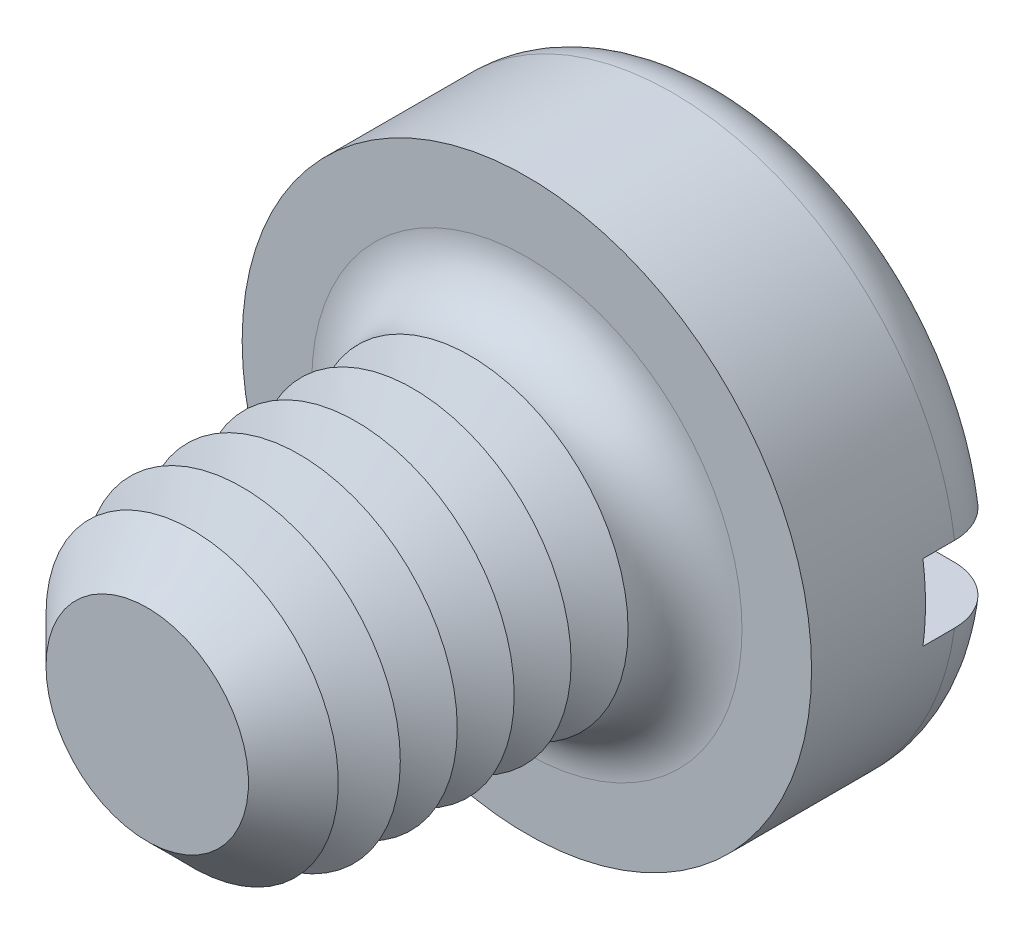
ISO-10303-21;
HEADER;
FILE_DESCRIPTION(('STEP AP214'),'2;1');
FILE_NAME('part.step','',(''),(''),'','','');
FILE_SCHEMA(('AUTOMOTIVE_DESIGN { 1 0 10303 214 1 1 1 1 }'));
ENDSEC;
DATA;
#1=APPLICATION_CONTEXT('core data for automotive mechanical design processes');
#2=APPLICATION_PROTOCOL_DEFINITION('international standard','automotive_design',2000,#1);
#3=PRODUCT_CONTEXT('',#1,'mechanical');
#4=PRODUCT('Part','Part','',(#3));
#5=PRODUCT_RELATED_PRODUCT_CATEGORY('part','',(#4));
#6=PRODUCT_DEFINITION_FORMATION('','',#4);
#7=PRODUCT_DEFINITION_CONTEXT('part definition',#1,'design');
#8=PRODUCT_DEFINITION('design','',#6,#7);
#9=PRODUCT_DEFINITION_SHAPE('','',#8);
#10=(LENGTH_UNIT() NAMED_UNIT(*) SI_UNIT(.MILLI.,.METRE.));
#11=(NAMED_UNIT(*) PLANE_ANGLE_UNIT() SI_UNIT($,.RADIAN.));
#12=(NAMED_UNIT(*) SI_UNIT($,.STERADIAN.) SOLID_ANGLE_UNIT());
#13=UNCERTAINTY_MEASURE_WITH_UNIT(LENGTH_MEASURE(1.E-05),#10,'distance_accuracy_value','');
#14=(GEOMETRIC_REPRESENTATION_CONTEXT(3) GLOBAL_UNCERTAINTY_ASSIGNED_CONTEXT((#13)) GLOBAL_UNIT_ASSIGNED_CONTEXT((#10,
#11,#12)) REPRESENTATION_CONTEXT('',''));
#15=CARTESIAN_POINT('',(0.,0.,0.));
#16=DIRECTION('',(0.,0.,1.));
#17=DIRECTION('',(1.,0.,0.));
#18=AXIS2_PLACEMENT_3D('',#15,#16,#17);
#19=CARTESIAN_POINT('',(0.,0.,-1.6));
#20=DIRECTION('',(0.,0.,1.));
#21=DIRECTION('',(1.,0.,0.));
#22=AXIS2_PLACEMENT_3D('',#19,#20,#21);
#23=PLANE('',#22);
#24=CARTESIAN_POINT('',(0.,0.,-1.6));
#25=DIRECTION('',(0.,0.,1.));
#26=DIRECTION('',(1.,0.,0.));
#27=AXIS2_PLACEMENT_3D('',#24,#25,#26);
#28=CIRCLE('',#27,1.8);
#29=CARTESIAN_POINT('',(-1.77482393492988,0.3,-1.6));
#30=VERTEX_POINT('',#29);
#31=CARTESIAN_POINT('',(1.77482393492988,0.3,-1.6));
#32=VERTEX_POINT('',#31);
#33=EDGE_CURVE('E116',#30,#32,#28,.F.);
#34=ORIENTED_EDGE('',*,*,#33,.T.);
#35=DIRECTION('',(1.,0.,0.));
#36=VECTOR('',#35,1.);
#37=CARTESIAN_POINT('',(-2.25,0.3,-1.6));
#38=LINE('',#37,#36);
#39=EDGE_CURVE('E111',#30,#32,#38,.T.);
#40=ORIENTED_EDGE('',*,*,#39,.F.);
#41=EDGE_LOOP('',(#34,#40));
#42=FACE_BOUND('',#41,.T.);
#43=ADVANCED_FACE('F39',(#42),#23,.F.);
#44=CARTESIAN_POINT('',(0.,0.,-1.15));
#45=DIRECTION('',(0.,0.,1.));
#46=DIRECTION('',(1.,0.,0.));
#47=AXIS2_PLACEMENT_3D('',#44,#45,#46);
#48=TOROIDAL_SURFACE('',#47,1.8,0.45);
#49=CARTESIAN_POINT('',(-2.09367249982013,0.3,-1.4713087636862));
#50=CARTESIAN_POINT('',(-2.07531034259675,0.3,-1.48912990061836));
#51=CARTESIAN_POINT('',(-2.05541605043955,0.3,-1.50540110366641));
#52=CARTESIAN_POINT('',(-2.01315405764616,0.3,-1.53437465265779));
#53=CARTESIAN_POINT('',(-1.99078310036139,0.3,-1.54707221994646));
#54=CARTESIAN_POINT('',(-1.94425163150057,0.3,-1.56853090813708));
#55=CARTESIAN_POINT('',(-1.92009286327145,0.3,-1.57729580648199));
#56=CARTESIAN_POINT('',(-1.8706617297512,0.3,-1.59068015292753));
#57=CARTESIAN_POINT('',(-1.84538964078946,0.3,-1.59530062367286));
#58=CARTESIAN_POINT('',(-1.7942134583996,0.3,-1.60031507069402));
#59=CARTESIAN_POINT('',(-1.76830582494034,0.3,-1.60067291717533));
#60=CARTESIAN_POINT('',(-1.71679040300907,0.3,-1.59707477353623));
#61=CARTESIAN_POINT('',(-1.69118264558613,0.3,-1.59311834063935));
#62=CARTESIAN_POINT('',(-1.64075792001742,0.3,-1.58095464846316));
#63=CARTESIAN_POINT('',(-1.61594989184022,0.3,-1.57271029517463));
#64=CARTESIAN_POINT('',(-1.56806655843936,0.3,-1.55217762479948));
#65=CARTESIAN_POINT('',(-1.54499130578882,0.3,-1.53988918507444));
#66=CARTESIAN_POINT('',(-1.50122413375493,0.3,-1.51158963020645));
#67=CARTESIAN_POINT('',(-1.48053389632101,0.3,-1.49557591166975));
#68=CARTESIAN_POINT('',(-1.44217532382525,0.3,-1.46026359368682));
#69=CARTESIAN_POINT('',(-1.42450683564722,0.3,-1.4409651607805));
#70=CARTESIAN_POINT('',(-1.39293961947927,0.3,-1.39986821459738));
#71=CARTESIAN_POINT('',(-1.37899788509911,0.3,-1.37810275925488));
#72=CARTESIAN_POINT('',(-1.35506190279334,0.3,-1.33249939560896));
#73=CARTESIAN_POINT('',(-1.34506709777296,0.3,-1.30866178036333));
#74=CARTESIAN_POINT('',(-1.3295415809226,0.3,-1.26015137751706));
#75=CARTESIAN_POINT('',(-1.32391771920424,0.3,-1.23550839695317));
#76=CARTESIAN_POINT('',(-1.31696995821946,0.3,-1.18562442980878));
#77=CARTESIAN_POINT('',(-1.31564552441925,0.3,-1.16038351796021));
#78=CARTESIAN_POINT('',(-1.31732714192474,0.3,-1.11049178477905));
#79=CARTESIAN_POINT('',(-1.32025766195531,0.3,-1.08583837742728));
#80=CARTESIAN_POINT('',(-1.3302124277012,0.3,-1.03737369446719));
#81=CARTESIAN_POINT('',(-1.33723664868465,0.3,-1.01356241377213));
#82=CARTESIAN_POINT('',(-1.35515820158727,0.3,-0.967413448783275));
#83=CARTESIAN_POINT('',(-1.36606032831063,0.3,-0.945077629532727));
#84=CARTESIAN_POINT('',(-1.39139351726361,0.3,-0.902507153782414));
#85=CARTESIAN_POINT('',(-1.40582489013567,0.3,-0.882272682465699));
#86=CARTESIAN_POINT('',(-1.43808691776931,0.3,-0.844072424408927));
#87=CARTESIAN_POINT('',(-1.4559757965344,0.3,-0.826155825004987));
#88=CARTESIAN_POINT('',(-1.49445205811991,0.3,-0.793502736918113));
#89=CARTESIAN_POINT('',(-1.51503974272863,0.3,-0.778766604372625));
#90=CARTESIAN_POINT('',(-1.55880475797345,0.3,-0.752571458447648));
#91=CARTESIAN_POINT('',(-1.58202794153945,0.3,-0.741189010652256));
#92=CARTESIAN_POINT('',(-1.63004083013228,0.3,-0.722432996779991));
#93=CARTESIAN_POINT('',(-1.65483064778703,0.3,-0.715059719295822));
#94=CARTESIAN_POINT('',(-1.70558060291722,0.3,-0.704463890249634));
#95=CARTESIAN_POINT('',(-1.73155090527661,0.3,-0.701289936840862));
#96=CARTESIAN_POINT('',(-1.78365633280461,0.3,-0.699350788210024));
#97=CARTESIAN_POINT('',(-1.80979145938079,0.3,-0.700585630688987));
#98=CARTESIAN_POINT('',(-1.86145503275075,0.3,-0.70744393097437));
#99=CARTESIAN_POINT('',(-1.88698403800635,0.3,-0.713063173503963));
#100=CARTESIAN_POINT('',(-1.93672112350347,0.3,-0.728546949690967));
#101=CARTESIAN_POINT('',(-1.96092925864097,0.3,-0.738411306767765));
#102=CARTESIAN_POINT('',(-2.00710191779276,0.3,-0.762015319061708));
#103=CARTESIAN_POINT('',(-2.02908465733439,0.3,-0.775719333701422));
#104=CARTESIAN_POINT('',(-2.0704025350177,0.3,-0.806663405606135));
#105=CARTESIAN_POINT('',(-2.08973782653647,0.3,-0.823903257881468));
#106=CARTESIAN_POINT('',(-2.12497879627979,0.3,-0.861218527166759));
#107=CARTESIAN_POINT('',(-2.1409209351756,0.3,-0.881259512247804));
#108=CARTESIAN_POINT('',(-2.16917502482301,0.3,-0.92375535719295));
#109=CARTESIAN_POINT('',(-2.18148717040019,0.3,-0.946210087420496));
#110=CARTESIAN_POINT('',(-2.20201023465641,0.3,-0.99266079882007));
#111=CARTESIAN_POINT('',(-2.21025973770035,0.3,-1.01663973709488));
#112=CARTESIAN_POINT('',(-2.22258852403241,0.3,-1.06564563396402));
#113=CARTESIAN_POINT('',(-2.22666813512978,0.3,-1.0906725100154));
#114=CARTESIAN_POINT('',(-2.23052418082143,0.3,-1.14090288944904));
#115=CARTESIAN_POINT('',(-2.23032644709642,0.3,-1.16610441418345));
#116=CARTESIAN_POINT('',(-2.22569614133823,0.3,-1.21612212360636));
#117=CARTESIAN_POINT('',(-2.2212625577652,0.3,-1.24093821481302));
#118=CARTESIAN_POINT('',(-2.20829785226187,0.3,-1.2894516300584));
#119=CARTESIAN_POINT('',(-2.19976997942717,0.3,-1.31314982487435));
#120=CARTESIAN_POINT('',(-2.17887390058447,0.3,-1.35876313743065));
#121=CARTESIAN_POINT('',(-2.1665103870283,0.3,-1.3806803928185));
#122=CARTESIAN_POINT('',(-2.14384463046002,0.3,-1.4140108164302));
#123=CARTESIAN_POINT('',(-2.13462949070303,0.3,-1.42617780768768));
#124=CARTESIAN_POINT('',(-2.1150151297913,0.3,-1.44951629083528));
#125=CARTESIAN_POINT('',(-2.10461591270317,0.3,-1.46068778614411));
#126=CARTESIAN_POINT('',(-2.09367249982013,0.3,-1.4713087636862));
#127=B_SPLINE_CURVE_WITH_KNOTS('',3,(#49,#50,#51,#52,#53,#54,#55,#56,#57,#58,#59,#60,#61,#62,
#63,#64,#65,#66,#67,#68,#69,#70,#71,#72,#73,#74,#75,#76,#77,#78,#79,#80,#81,#82,#83,#84,#85,#86,
#87,#88,#89,#90,#91,#92,#93,#94,#95,#96,#97,#98,#99,#100,#101,#102,#103,#104,#105,#106,#107,
#108,#109,#110,#111,#112,#113,#114,#115,#116,#117,#118,#119,#120,#121,#122,#123,#124,#125,#126),
.UNSPECIFIED.,.T.,.F.,(4,2,2,2,2,2,2,2,2,2,2,2,2,2,2,2,2,2,2,2,2,2,2,2,2,2,2,2,2,2,2,2,2,2,2,2,
2,2,4),(0.,0.0767085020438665,0.153519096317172,0.230255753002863,0.306973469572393,
0.384340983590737,0.461716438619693,0.539772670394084,0.617831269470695,0.695944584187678,
0.774053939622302,0.851218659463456,0.928372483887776,1.00383319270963,1.07928451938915,
1.15341274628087,1.22754052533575,1.30176027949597,1.37598656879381,1.45159320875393,
1.52720831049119,1.6044355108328,1.68166826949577,1.75978723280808,1.8379068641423,
1.91595148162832,1.99399285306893,2.07133254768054,2.14866775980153,2.22512456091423,
2.30157725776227,2.3772891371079,2.45299506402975,2.52824391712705,2.60351074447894,
2.67871794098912,2.75383349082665,2.79955010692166,2.84526656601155),.UNSPECIFIED.);
#128=CARTESIAN_POINT('',(-2.22991031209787,0.3,-1.14999999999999));
#129=VERTEX_POINT('',#128);
#130=EDGE_CURVE('E225',#129,#30,#127,.T.);
#131=ORIENTED_EDGE('',*,*,#130,.F.);
#132=CARTESIAN_POINT('',(0.,0.,-1.15));
#133=DIRECTION('',(0.,0.,1.));
#134=DIRECTION('',(1.,0.,0.));
#135=AXIS2_PLACEMENT_3D('',#132,#133,#134);
#136=CIRCLE('',#135,2.25);
#137=CARTESIAN_POINT('',(2.22991031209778,0.3,-1.15));
#138=VERTEX_POINT('',#137);
#139=EDGE_CURVE('E125',#138,#129,#136,.T.);
#140=ORIENTED_EDGE('',*,*,#139,.F.);
#141=CARTESIAN_POINT('',(1.39325818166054,0.3,-1.39903402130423));
#142=CARTESIAN_POINT('',(1.40771723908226,0.3,-1.42030595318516));
#143=CARTESIAN_POINT('',(1.4240122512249,0.3,-1.4403555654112));
#144=CARTESIAN_POINT('',(1.45976320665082,0.3,-1.4774406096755));
#145=CARTESIAN_POINT('',(1.47922380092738,0.3,-1.49447152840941));
#146=CARTESIAN_POINT('',(1.5206923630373,0.3,-1.52502510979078));
#147=CARTESIAN_POINT('',(1.54269721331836,0.3,-1.53855200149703));
#148=CARTESIAN_POINT('',(1.58863815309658,0.3,-1.56176272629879));
#149=CARTESIAN_POINT('',(1.61257369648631,0.3,-1.57144764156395));
#150=CARTESIAN_POINT('',(1.66199169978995,0.3,-1.58680804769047));
#151=CARTESIAN_POINT('',(1.68748839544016,0.3,-1.59243778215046));
#152=CARTESIAN_POINT('',(1.73906656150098,0.3,-1.59934902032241));
#153=CARTESIAN_POINT('',(1.76514807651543,0.3,-1.60063019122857));
#154=CARTESIAN_POINT('',(1.81721740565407,0.3,-1.59879130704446));
#155=CARTESIAN_POINT('',(1.84320486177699,0.3,-1.59566102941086));
#156=CARTESIAN_POINT('',(1.89427635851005,0.3,-1.58504931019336));
#157=CARTESIAN_POINT('',(1.91936042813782,0.3,-1.57756800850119));
#158=CARTESIAN_POINT('',(1.9677137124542,0.3,-1.55851722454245));
#159=CARTESIAN_POINT('',(1.99099484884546,0.3,-1.5469780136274));
#160=CARTESIAN_POINT('',(2.03525897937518,0.3,-1.52011224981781));
#161=CARTESIAN_POINT('',(2.05624211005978,0.3,-1.50478592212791));
#162=CARTESIAN_POINT('',(2.09506403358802,0.3,-1.47096472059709));
#163=CARTESIAN_POINT('',(2.11293536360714,0.3,-1.45250719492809));
#164=CARTESIAN_POINT('',(2.14528563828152,0.3,-1.41282609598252));
#165=CARTESIAN_POINT('',(2.15976477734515,0.3,-1.39160268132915));
#166=CARTESIAN_POINT('',(2.18476262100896,0.3,-1.34723254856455));
#167=CARTESIAN_POINT('',(2.19532119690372,0.3,-1.32410828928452));
#168=CARTESIAN_POINT('',(2.21237438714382,0.3,-1.27640693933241));
#169=CARTESIAN_POINT('',(2.21886918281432,0.3,-1.25182991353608));
#170=CARTESIAN_POINT('',(2.2275687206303,0.3,-1.20210937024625));
#171=CARTESIAN_POINT('',(2.22980376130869,0.3,-1.17697115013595));
#172=CARTESIAN_POINT('',(2.23000940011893,0.3,-1.12667754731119));
#173=CARTESIAN_POINT('',(2.22798009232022,0.3,-1.10152216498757));
#174=CARTESIAN_POINT('',(2.21972856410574,0.3,-1.05197773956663));
#175=CARTESIAN_POINT('',(2.21351744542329,0.3,-1.02758684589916));
#176=CARTESIAN_POINT('',(2.19709696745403,0.3,-0.980190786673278));
#177=CARTESIAN_POINT('',(2.18688760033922,0.3,-0.957185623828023));
#178=CARTESIAN_POINT('',(2.1627435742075,0.3,-0.913157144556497));
#179=CARTESIAN_POINT('',(2.14880093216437,0.3,-0.892138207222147));
#180=CARTESIAN_POINT('',(2.11760640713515,0.3,-0.852719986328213));
#181=CARTESIAN_POINT('',(2.10035443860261,0.3,-0.834320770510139));
#182=CARTESIAN_POINT('',(2.06291254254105,0.3,-0.80052923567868));
#183=CARTESIAN_POINT('',(2.04270386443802,0.3,-0.785157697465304));
#184=CARTESIAN_POINT('',(2.0000139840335,0.3,-0.757986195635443));
#185=CARTESIAN_POINT('',(1.97753267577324,0.3,-0.746186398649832));
#186=CARTESIAN_POINT('',(1.93069507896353,0.3,-0.726364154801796));
#187=CARTESIAN_POINT('',(1.90632219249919,0.3,-0.718380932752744));
#188=CARTESIAN_POINT('',(1.85658993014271,0.3,-0.706569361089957));
#189=CARTESIAN_POINT('',(1.83123049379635,0.3,-0.702741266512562));
#190=CARTESIAN_POINT('',(1.77994107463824,0.3,-0.699306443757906));
#191=CARTESIAN_POINT('',(1.75400788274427,0.3,-0.69974759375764));
#192=CARTESIAN_POINT('',(1.70257608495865,0.3,-0.704939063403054));
#193=CARTESIAN_POINT('',(1.67707750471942,0.3,-0.709689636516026));
#194=CARTESIAN_POINT('',(1.62701662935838,0.3,-0.723419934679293));
#195=CARTESIAN_POINT('',(1.60246387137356,0.3,-0.732434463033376));
#196=CARTESIAN_POINT('',(1.55521886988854,0.3,-0.754458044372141));
#197=CARTESIAN_POINT('',(1.53252668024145,0.3,-0.76746721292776));
#198=CARTESIAN_POINT('',(1.48966925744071,0.3,-0.797124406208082));
#199=CARTESIAN_POINT('',(1.46950315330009,0.3,-0.813771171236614));
#200=CARTESIAN_POINT('',(1.43229728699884,0.3,-0.850255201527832));
#201=CARTESIAN_POINT('',(1.41525734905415,0.3,-0.870092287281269));
#202=CARTESIAN_POINT('',(1.3850470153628,0.3,-0.912123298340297));
#203=CARTESIAN_POINT('',(1.37182821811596,0.3,-0.934282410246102));
#204=CARTESIAN_POINT('',(1.34939737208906,0.3,-0.980542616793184));
#205=CARTESIAN_POINT('',(1.34018456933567,0.3,-1.00464334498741));
#206=CARTESIAN_POINT('',(1.32624172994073,0.3,-1.05352472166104));
#207=CARTESIAN_POINT('',(1.32141599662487,0.3,-1.07827808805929));
#208=CARTESIAN_POINT('',(1.31606478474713,0.3,-1.12825155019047));
#209=CARTESIAN_POINT('',(1.31553992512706,0.3,-1.15347171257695));
#210=CARTESIAN_POINT('',(1.31878307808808,0.3,-1.20323022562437));
#211=CARTESIAN_POINT('',(1.32248353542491,0.3,-1.22777305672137));
#212=CARTESIAN_POINT('',(1.33394086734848,0.3,-1.27586981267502));
#213=CARTESIAN_POINT('',(1.34169274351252,0.3,-1.2994249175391));
#214=CARTESIAN_POINT('',(1.35704250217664,0.3,-1.33561898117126));
#215=CARTESIAN_POINT('',(1.36341395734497,0.3,-1.34879219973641));
#216=CARTESIAN_POINT('',(1.37741190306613,0.3,-1.37445328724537));
#217=CARTESIAN_POINT('',(1.38503837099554,0.3,-1.38694116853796));
#218=CARTESIAN_POINT('',(1.39325818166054,0.3,-1.39903402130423));
#219=B_SPLINE_CURVE_WITH_KNOTS('',3,(#141,#142,#143,#144,#145,#146,#147,#148,#149,#150,#151,
#152,#153,#154,#155,#156,#157,#158,#159,#160,#161,#162,#163,#164,#165,#166,#167,#168,#169,#170,
#171,#172,#173,#174,#175,#176,#177,#178,#179,#180,#181,#182,#183,#184,#185,#186,#187,#188,#189,
#190,#191,#192,#193,#194,#195,#196,#197,#198,#199,#200,#201,#202,#203,#204,#205,#206,#207,#208,
#209,#210,#211,#212,#213,#214,#215,#216,#217,#218),.UNSPECIFIED.,.T.,.F.,(4,2,2,2,2,2,2,2,2,2,2,
2,2,2,2,2,2,2,2,2,2,2,2,2,2,2,2,2,2,2,2,2,2,2,2,2,2,2,4),(0.,0.0771077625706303,
0.154329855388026,0.231458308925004,0.308565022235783,0.386528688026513,0.464498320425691,
0.542648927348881,0.620797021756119,0.698374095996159,0.77594655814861,0.852651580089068,
0.929352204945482,1.00524992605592,1.08114426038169,1.15649673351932,1.2318475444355,
1.30699910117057,1.38215080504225,1.45746451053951,1.53278016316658,1.60859599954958,
1.68441537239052,1.76099806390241,1.83758545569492,1.91503273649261,1.99248457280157,
2.07057979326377,2.14867727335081,2.22674775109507,2.30481383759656,2.38184276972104,
2.45885719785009,2.53414829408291,2.6094502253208,2.68356487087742,2.75758829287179,
2.80142397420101,2.84525886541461),.UNSPECIFIED.);
#220=EDGE_CURVE('E227',#32,#138,#219,.T.);
#221=ORIENTED_EDGE('',*,*,#220,.F.);
#222=ORIENTED_EDGE('',*,*,#33,.F.);
#223=EDGE_LOOP('',(#131,#140,#221,#222));
#224=FACE_BOUND('',#223,.T.);
#225=ADVANCED_FACE('F209',(#224),#48,.T.);
#226=CARTESIAN_POINT('',(0.,0.,-1.6));
#227=DIRECTION('',(0.,0.,1.));
#228=DIRECTION('',(1.,0.,0.));
#229=AXIS2_PLACEMENT_3D('',#226,#227,#228);
#230=CYLINDRICAL_SURFACE('',#229,2.25);
#231=DIRECTION('',(0.,0.,1.));
#232=VECTOR('',#231,1.);
#233=CARTESIAN_POINT('',(2.22991031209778,0.3,-1.6));
#234=LINE('',#233,#232);
#235=CARTESIAN_POINT('',(2.22991031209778,0.3,-0.9));
#236=VERTEX_POINT('',#235);
#237=EDGE_CURVE('E239',#138,#236,#234,.T.);
#238=ORIENTED_EDGE('',*,*,#237,.F.);
#239=ORIENTED_EDGE('',*,*,#139,.T.);
#240=DIRECTION('',(0.,0.,1.));
#241=VECTOR('',#240,1.);
#242=CARTESIAN_POINT('',(-2.22991031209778,0.3,-1.6));
#243=LINE('',#242,#241);
#244=CARTESIAN_POINT('',(-2.22991031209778,0.3,-0.9));
#245=VERTEX_POINT('',#244);
#246=EDGE_CURVE('E63',#245,#129,#243,.F.);
#247=ORIENTED_EDGE('',*,*,#246,.F.);
#248=CARTESIAN_POINT('',(0.,0.,-0.9));
#249=DIRECTION('',(0.,0.,-1.));
#250=DIRECTION('',(-1.,0.,0.));
#251=AXIS2_PLACEMENT_3D('',#248,#249,#250);
#252=CIRCLE('',#251,2.25);
#253=CARTESIAN_POINT('',(-2.22991031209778,-0.3,-0.9));
#254=VERTEX_POINT('',#253);
#255=EDGE_CURVE('E43',#245,#254,#252,.F.);
#256=ORIENTED_EDGE('',*,*,#255,.T.);
#257=DIRECTION('',(0.,0.,1.));
#258=VECTOR('',#257,1.);
#259=CARTESIAN_POINT('',(-2.22991031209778,-0.3,-1.6));
#260=LINE('',#259,#258);
#261=CARTESIAN_POINT('',(-2.22991031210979,-0.3,-1.15000000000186));
#262=VERTEX_POINT('',#261);
#263=EDGE_CURVE('E236',#262,#254,#260,.T.);
#264=ORIENTED_EDGE('',*,*,#263,.F.);
#265=CARTESIAN_POINT('',(2.22991031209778,-0.3,-1.15));
#266=VERTEX_POINT('',#265);
#267=EDGE_CURVE('E127',#262,#266,#136,.T.);
#268=ORIENTED_EDGE('',*,*,#267,.T.);
#269=DIRECTION('',(0.,0.,1.));
#270=VECTOR('',#269,1.);
#271=CARTESIAN_POINT('',(2.22991031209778,-0.3,-1.6));
#272=LINE('',#271,#270);
#273=CARTESIAN_POINT('',(2.22991031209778,-0.3,-0.9));
#274=VERTEX_POINT('',#273);
#275=EDGE_CURVE('E55',#274,#266,#272,.F.);
#276=ORIENTED_EDGE('',*,*,#275,.F.);
#277=EDGE_CURVE('E11',#274,#236,#252,.F.);
#278=ORIENTED_EDGE('',*,*,#277,.T.);
#279=EDGE_LOOP('',(#238,#239,#247,#256,#264,#268,#276,#278));
#280=FACE_BOUND('',#279,.T.);
#281=CARTESIAN_POINT('',(0.,0.,0.));
#282=DIRECTION('',(0.,0.,1.));
#283=DIRECTION('',(1.,0.,0.));
#284=AXIS2_PLACEMENT_3D('',#281,#282,#283);
#285=CIRCLE('',#284,2.25);
#286=CARTESIAN_POINT('',(2.25,0.,0.));
#287=VERTEX_POINT('',#286);
#288=EDGE_CURVE('E242',#287,#287,#285,.T.);
#289=ORIENTED_EDGE('',*,*,#288,.F.);
#290=EDGE_LOOP('',(#289));
#291=FACE_BOUND('',#290,.T.);
#292=ADVANCED_FACE('F205',(#280,#291),#230,.T.);
#293=CARTESIAN_POINT('',(1.77482393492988,-0.3,-1.6));
#294=VERTEX_POINT('',#293);
#295=CARTESIAN_POINT('',(-1.77482393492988,-0.3,-1.6));
#296=VERTEX_POINT('',#295);
#297=EDGE_CURVE('E109',#294,#296,#28,.F.);
#298=ORIENTED_EDGE('',*,*,#297,.T.);
#299=DIRECTION('',(-1.,0.,0.));
#300=VECTOR('',#299,1.);
#301=CARTESIAN_POINT('',(-2.25,-0.3,-1.6));
#302=LINE('',#301,#300);
#303=EDGE_CURVE('E96',#294,#296,#302,.T.);
#304=ORIENTED_EDGE('',*,*,#303,.F.);
#305=EDGE_LOOP('',(#298,#304));
#306=FACE_BOUND('',#305,.T.);
#307=ADVANCED_FACE('F108',(#306),#23,.F.);
#308=CARTESIAN_POINT('',(0.,0.,0.));
#309=DIRECTION('',(0.,0.,1.));
#310=DIRECTION('',(1.,0.,0.));
#311=AXIS2_PLACEMENT_3D('',#308,#309,#310);
#312=PLANE('',#311);
#313=CARTESIAN_POINT('',(0.,0.,0.));
#314=DIRECTION('',(0.,0.,1.));
#315=DIRECTION('',(1.,0.,0.));
#316=AXIS2_PLACEMENT_3D('',#313,#314,#315);
#317=CIRCLE('',#316,1.7);
#318=CARTESIAN_POINT('',(1.7,0.,0.));
#319=VERTEX_POINT('',#318);
#320=EDGE_CURVE('E115',#319,#319,#317,.F.);
#321=ORIENTED_EDGE('',*,*,#320,.T.);
#322=EDGE_LOOP('',(#321));
#323=FACE_BOUND('',#322,.T.);
#324=ORIENTED_EDGE('',*,*,#288,.T.);
#325=EDGE_LOOP('',(#324));
#326=FACE_BOUND('',#325,.T.);
#327=ADVANCED_FACE('F204',(#323,#326),#312,.T.);
#328=CARTESIAN_POINT('',(-2.09367249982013,-0.3,-1.4713087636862));
#329=CARTESIAN_POINT('',(-2.11176539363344,-0.3,-1.45374579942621));
#330=CARTESIAN_POINT('',(-2.1283968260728,-0.3,-1.43465254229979));
#331=CARTESIAN_POINT('',(-2.15823692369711,-0.3,-1.39393307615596));
#332=CARTESIAN_POINT('',(-2.17144184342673,-0.3,-1.37230413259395));
#333=CARTESIAN_POINT('',(-2.19402281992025,-0.3,-1.32713362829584));
#334=CARTESIAN_POINT('',(-2.20339951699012,-0.3,-1.30359238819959));
#335=CARTESIAN_POINT('',(-2.21804409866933,-0.3,-1.25527081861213));
#336=CARTESIAN_POINT('',(-2.22331295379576,-0.3,-1.23049078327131));
#337=CARTESIAN_POINT('',(-2.22957448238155,-0.3,-1.18050893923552));
#338=CARTESIAN_POINT('',(-2.23058617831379,-0.3,-1.15530951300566));
#339=CARTESIAN_POINT('',(-2.22835535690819,-0.3,-1.10509920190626));
#340=CARTESIAN_POINT('',(-2.22511277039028,-0.3,-1.08008832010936));
#341=CARTESIAN_POINT('',(-2.21448018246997,-0.3,-1.03101646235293));
#342=CARTESIAN_POINT('',(-2.20709836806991,-0.3,-1.00695371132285));
#343=CARTESIAN_POINT('',(-2.18841075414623,-0.3,-0.960404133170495));
#344=CARTESIAN_POINT('',(-2.17710493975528,-0.3,-0.937917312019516));
#345=CARTESIAN_POINT('',(-2.15086234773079,-0.3,-0.895085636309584));
#346=CARTESIAN_POINT('',(-2.13591537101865,-0.3,-0.874747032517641));
#347=CARTESIAN_POINT('',(-2.1028415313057,-0.3,-0.836845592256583));
#348=CARTESIAN_POINT('',(-2.08471458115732,-0.3,-0.819282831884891));
#349=CARTESIAN_POINT('',(-2.0456590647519,-0.3,-0.78729174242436));
#350=CARTESIAN_POINT('',(-2.0247112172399,-0.3,-0.772886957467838));
#351=CARTESIAN_POINT('',(-1.98071452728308,-0.3,-0.747756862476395));
#352=CARTESIAN_POINT('',(-1.95766557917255,-0.3,-0.737031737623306));
#353=CARTESIAN_POINT('',(-1.90986554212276,-0.3,-0.71944451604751));
#354=CARTESIAN_POINT('',(-1.88509923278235,-0.3,-0.712623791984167));
#355=CARTESIAN_POINT('',(-1.83477837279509,-0.3,-0.703186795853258));
#356=CARTESIAN_POINT('',(-1.80922377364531,-0.3,-0.700570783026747));
#357=CARTESIAN_POINT('',(-1.75774893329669,-0.3,-0.699591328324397));
#358=CARTESIAN_POINT('',(-1.73182778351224,-0.3,-0.701275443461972));
#359=CARTESIAN_POINT('',(-1.68062744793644,-0.3,-0.708937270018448));
#360=CARTESIAN_POINT('',(-1.6553482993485,-0.3,-0.714915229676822));
#361=CARTESIAN_POINT('',(-1.6059539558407,-0.3,-0.731056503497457));
#362=CARTESIAN_POINT('',(-1.58184881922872,-0.3,-0.741250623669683));
#363=CARTESIAN_POINT('',(-1.53569497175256,-0.3,-0.765548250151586));
#364=CARTESIAN_POINT('',(-1.51364629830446,-0.3,-0.779651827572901));
#365=CARTESIAN_POINT('',(-1.47229470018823,-0.3,-0.811355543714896));
#366=CARTESIAN_POINT('',(-1.45298625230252,-0.3,-0.828948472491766));
#367=CARTESIAN_POINT('',(-1.41765142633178,-0.3,-0.867170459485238));
#368=CARTESIAN_POINT('',(-1.40162480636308,-0.3,-0.887799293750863));
#369=CARTESIAN_POINT('',(-1.37358365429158,-0.3,-0.93118317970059));
#370=CARTESIAN_POINT('',(-1.3615121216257,-0.3,-0.953901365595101));
#371=CARTESIAN_POINT('',(-1.34145576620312,-0.3,-1.00107529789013));
#372=CARTESIAN_POINT('',(-1.33347032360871,-0.3,-1.02553078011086));
#373=CARTESIAN_POINT('',(-1.32199536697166,-0.3,-1.07489401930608));
#374=CARTESIAN_POINT('',(-1.31840873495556,-0.3,-1.09977921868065));
#375=CARTESIAN_POINT('',(-1.31553052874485,-0.3,-1.1497957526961));
#376=CARTESIAN_POINT('',(-1.31623852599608,-0.3,-1.17492706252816));
#377=CARTESIAN_POINT('',(-1.32188368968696,-0.3,-1.22435119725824));
#378=CARTESIAN_POINT('',(-1.32676151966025,-0.3,-1.24865083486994));
#379=CARTESIAN_POINT('',(-1.34050334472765,-0.3,-1.29609421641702));
#380=CARTESIAN_POINT('',(-1.34936742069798,-0.3,-1.31923793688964));
#381=CARTESIAN_POINT('',(-1.37086295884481,-0.3,-1.36387796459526));
#382=CARTESIAN_POINT('',(-1.38351729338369,-0.3,-1.38536324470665));
#383=CARTESIAN_POINT('',(-1.41218367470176,-0.3,-1.42596199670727));
#384=CARTESIAN_POINT('',(-1.42819606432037,-0.3,-1.44507522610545));
#385=CARTESIAN_POINT('',(-1.46347664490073,-0.3,-1.48081087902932));
#386=CARTESIAN_POINT('',(-1.48280543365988,-0.3,-1.49737347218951));
#387=CARTESIAN_POINT('',(-1.5239232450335,-0.3,-1.52709508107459));
#388=CARTESIAN_POINT('',(-1.54571253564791,-0.3,-1.54025372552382));
#389=CARTESIAN_POINT('',(-1.59160097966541,-0.3,-1.56305446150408));
#390=CARTESIAN_POINT('',(-1.61573734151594,-0.3,-1.57262172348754));
#391=CARTESIAN_POINT('',(-1.66526504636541,-0.3,-1.58760700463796));
#392=CARTESIAN_POINT('',(-1.69065641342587,-0.3,-1.59302494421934));
#393=CARTESIAN_POINT('',(-1.74220154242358,-0.3,-1.59958446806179));
#394=CARTESIAN_POINT('',(-1.7683598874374,-0.3,-1.60069012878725));
#395=CARTESIAN_POINT('',(-1.82049681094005,-0.3,-1.59847888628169));
#396=CARTESIAN_POINT('',(-1.8464753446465,-0.3,-1.59516091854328));
#397=CARTESIAN_POINT('',(-1.89742078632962,-0.3,-1.58419269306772));
#398=CARTESIAN_POINT('',(-1.92239041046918,-0.3,-1.57655503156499));
#399=CARTESIAN_POINT('',(-1.97064988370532,-0.3,-1.55715679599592));
#400=CARTESIAN_POINT('',(-1.99394179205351,-0.3,-1.54540138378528));
#401=CARTESIAN_POINT('',(-2.03003215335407,-0.3,-1.52312594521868));
#402=CARTESIAN_POINT('',(-2.04354254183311,-0.3,-1.51373809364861));
#403=CARTESIAN_POINT('',(-2.06946640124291,-0.3,-1.49355310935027));
#404=CARTESIAN_POINT('',(-2.08187987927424,-0.3,-1.48275598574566));
#405=CARTESIAN_POINT('',(-2.09367249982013,-0.3,-1.4713087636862));
#406=B_SPLINE_CURVE_WITH_KNOTS('',3,(#328,#329,#330,#331,#332,#333,#334,#335,#336,#337,#338,
#339,#340,#341,#342,#343,#344,#345,#346,#347,#348,#349,#350,#351,#352,#353,#354,#355,#356,#357,
#358,#359,#360,#361,#362,#363,#364,#365,#366,#367,#368,#369,#370,#371,#372,#373,#374,#375,#376,
#377,#378,#379,#380,#381,#382,#383,#384,#385,#386,#387,#388,#389,#390,#391,#392,#393,#394,#395,
#396,#397,#398,#399,#400,#401,#402,#403,#404,#405),.UNSPECIFIED.,.T.,.F.,(4,2,2,2,2,2,2,2,2,2,2,
2,2,2,2,2,2,2,2,2,2,2,2,2,2,2,2,2,2,2,2,2,2,2,2,2,2,2,4),(0.,0.0755864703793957,
0.151255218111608,0.226911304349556,0.302549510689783,0.377849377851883,0.453150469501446,
0.528303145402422,0.603456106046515,0.67882204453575,0.754190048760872,0.83010216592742,
0.906018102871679,0.982724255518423,1.05943513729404,1.13699806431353,1.21456547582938,
1.29270994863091,1.37085584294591,1.44884191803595,1.52682224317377,1.60362346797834,
1.68041303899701,1.75547480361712,1.83052907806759,1.90453278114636,1.9785379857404,
2.05299909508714,2.12746781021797,2.20347986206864,2.27950020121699,2.3570265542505,
2.43455439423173,2.5127267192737,2.59091785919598,2.66888216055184,2.74674907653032,
2.79601528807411,2.84528118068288),.UNSPECIFIED.);
#407=EDGE_CURVE('E103',#296,#262,#406,.T.);
#408=ORIENTED_EDGE('',*,*,#407,.F.);
#409=ORIENTED_EDGE('',*,*,#297,.F.);
#410=CARTESIAN_POINT('',(1.39325818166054,-0.3,-1.39903402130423));
#411=CARTESIAN_POINT('',(1.37924349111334,-0.3,-1.37841200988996));
#412=CARTESIAN_POINT('',(1.36693374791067,-0.3,-1.35661225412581));
#413=CARTESIAN_POINT('',(1.34612289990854,-0.3,-1.31124547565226));
#414=CARTESIAN_POINT('',(1.33762533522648,-0.3,-1.28767683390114));
#415=CARTESIAN_POINT('',(1.32472877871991,-0.3,-1.23943261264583));
#416=CARTESIAN_POINT('',(1.3203309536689,-0.3,-1.21475672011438));
#417=CARTESIAN_POINT('',(1.31579198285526,-0.3,-1.16502199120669));
#418=CARTESIAN_POINT('',(1.31564980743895,-0.3,-1.13996324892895));
#419=CARTESIAN_POINT('',(1.31960322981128,-0.3,-1.09044336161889));
#420=CARTESIAN_POINT('',(1.32365524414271,-0.3,-1.06597872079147));
#421=CARTESIAN_POINT('',(1.33579339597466,-0.3,-1.01807218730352));
#422=CARTESIAN_POINT('',(1.34387971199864,-0.3,-0.994630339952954));
#423=CARTESIAN_POINT('',(1.36386460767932,-0.3,-0.949319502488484));
#424=CARTESIAN_POINT('',(1.37577869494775,-0.3,-0.92745736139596));
#425=CARTESIAN_POINT('',(1.40303929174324,-0.3,-0.885990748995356));
#426=CARTESIAN_POINT('',(1.41838612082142,-0.3,-0.866386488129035));
#427=CARTESIAN_POINT('',(1.45239955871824,-0.3,-0.829572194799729));
#428=CARTESIAN_POINT('',(1.47112624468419,-0.3,-0.812417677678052));
#429=CARTESIAN_POINT('',(1.51114353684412,-0.3,-0.781418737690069));
#430=CARTESIAN_POINT('',(1.53243442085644,-0.3,-0.767574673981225));
#431=CARTESIAN_POINT('',(1.57744959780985,-0.3,-0.743302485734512));
#432=CARTESIAN_POINT('',(1.6012148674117,-0.3,-0.732950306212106));
#433=CARTESIAN_POINT('',(1.65013556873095,-0.3,-0.71633816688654));
#434=CARTESIAN_POINT('',(1.67529109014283,-0.3,-0.710078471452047));
#435=CARTESIAN_POINT('',(1.72654223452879,-0.3,-0.701786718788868));
#436=CARTESIAN_POINT('',(1.75264462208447,-0.3,-0.699796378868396));
#437=CARTESIAN_POINT('',(1.80481283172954,-0.3,-0.700236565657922));
#438=CARTESIAN_POINT('',(1.83087865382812,-0.3,-0.702667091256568));
#439=CARTESIAN_POINT('',(1.88216421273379,-0.3,-0.71188843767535));
#440=CARTESIAN_POINT('',(1.90738581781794,-0.3,-0.718668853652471));
#441=CARTESIAN_POINT('',(1.95631449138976,-0.3,-0.736408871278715));
#442=CARTESIAN_POINT('',(1.98002162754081,-0.3,-0.747368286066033));
#443=CARTESIAN_POINT('',(2.02500221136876,-0.3,-0.773046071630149));
#444=CARTESIAN_POINT('',(2.04629687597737,-0.3,-0.78772726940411));
#445=CARTESIAN_POINT('',(2.08608258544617,-0.3,-0.820494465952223));
#446=CARTESIAN_POINT('',(2.10457379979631,-0.3,-0.838580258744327));
#447=CARTESIAN_POINT('',(2.1380062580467,-0.3,-0.877422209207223));
#448=CARTESIAN_POINT('',(2.15298532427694,-0.3,-0.898145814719));
#449=CARTESIAN_POINT('',(2.17921311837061,-0.3,-0.941832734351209));
#450=CARTESIAN_POINT('',(2.19046204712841,-0.3,-0.964795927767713));
#451=CARTESIAN_POINT('',(2.20880507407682,-0.3,-1.01207981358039));
#452=CARTESIAN_POINT('',(2.2159367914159,-0.3,-1.0363859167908));
#453=CARTESIAN_POINT('',(2.22599386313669,-0.3,-1.08585317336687));
#454=CARTESIAN_POINT('',(2.22891936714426,-0.3,-1.11101429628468));
#455=CARTESIAN_POINT('',(2.23047255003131,-0.3,-1.16133395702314));
#456=CARTESIAN_POINT('',(2.22912306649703,-0.3,-1.18649179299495));
#457=CARTESIAN_POINT('',(2.22221641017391,-0.3,-1.236222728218));
#458=CARTESIAN_POINT('',(2.21665928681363,-0.3,-1.26079583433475));
#459=CARTESIAN_POINT('',(2.20150655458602,-0.3,-1.30864604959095));
#460=CARTESIAN_POINT('',(2.19191347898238,-0.3,-1.3319239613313));
#461=CARTESIAN_POINT('',(2.16897085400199,-0.3,-1.37654778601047));
#462=CARTESIAN_POINT('',(2.15562126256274,-0.3,-1.39789367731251));
#463=CARTESIAN_POINT('',(2.12549147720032,-0.3,-1.43814583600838));
#464=CARTESIAN_POINT('',(2.1086973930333,-0.3,-1.45704170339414));
#465=CARTESIAN_POINT('',(2.07219852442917,-0.3,-1.491773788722));
#466=CARTESIAN_POINT('',(2.0524936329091,-0.3,-1.50760989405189));
#467=CARTESIAN_POINT('',(2.01056127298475,-0.3,-1.53591667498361));
#468=CARTESIAN_POINT('',(1.98831430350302,-0.3,-1.54835845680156));
#469=CARTESIAN_POINT('',(1.94206418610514,-0.3,-1.5693763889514));
#470=CARTESIAN_POINT('',(1.91806093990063,-0.3,-1.57795232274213));
#471=CARTESIAN_POINT('',(1.86869953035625,-0.3,-1.5910955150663));
#472=CARTESIAN_POINT('',(1.84332941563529,-0.3,-1.59561788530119));
#473=CARTESIAN_POINT('',(1.7921914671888,-0.3,-1.60038767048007));
#474=CARTESIAN_POINT('',(1.76642362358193,-0.3,-1.60063497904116));
#475=CARTESIAN_POINT('',(1.71493241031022,-0.3,-1.59684388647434));
#476=CARTESIAN_POINT('',(1.6892123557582,-0.3,-1.59276040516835));
#477=CARTESIAN_POINT('',(1.63880694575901,-0.3,-1.58035661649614));
#478=CARTESIAN_POINT('',(1.61412189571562,-0.3,-1.5720350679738));
#479=CARTESIAN_POINT('',(1.56635013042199,-0.3,-1.55132424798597));
#480=CARTESIAN_POINT('',(1.54327365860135,-0.3,-1.53891136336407));
#481=CARTESIAN_POINT('',(1.49956705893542,-0.3,-1.51037484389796));
#482=CARTESIAN_POINT('',(1.478934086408,-0.3,-1.49425558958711));
#483=CARTESIAN_POINT('',(1.44732882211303,-0.3,-1.46489751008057));
#484=CARTESIAN_POINT('',(1.43548118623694,-0.3,-1.45258668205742));
#485=CARTESIAN_POINT('',(1.41324217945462,-0.3,-1.42671249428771));
#486=CARTESIAN_POINT('',(1.40285079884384,-0.3,-1.41314914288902));
#487=CARTESIAN_POINT('',(1.39325818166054,-0.3,-1.39903402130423));
#488=B_SPLINE_CURVE_WITH_KNOTS('',3,(#410,#411,#412,#413,#414,#415,#416,#417,#418,#419,#420,
#421,#422,#423,#424,#425,#426,#427,#428,#429,#430,#431,#432,#433,#434,#435,#436,#437,#438,#439,
#440,#441,#442,#443,#444,#445,#446,#447,#448,#449,#450,#451,#452,#453,#454,#455,#456,#457,#458,
#459,#460,#461,#462,#463,#464,#465,#466,#467,#468,#469,#470,#471,#472,#473,#474,#475,#476,#477,
#478,#479,#480,#481,#482,#483,#484,#485,#486,#487),.UNSPECIFIED.,.T.,.F.,(4,2,2,2,2,2,2,2,2,2,2,
2,2,2,2,2,2,2,2,2,2,2,2,2,2,2,2,2,2,2,2,2,2,2,2,2,2,2,4),(0.,0.0747398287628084,
0.149548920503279,0.224379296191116,0.299191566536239,0.373234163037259,0.447280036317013,
0.521629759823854,0.595986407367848,0.671825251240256,0.747672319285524,0.825076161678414,
0.902485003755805,0.98064685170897,1.05880868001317,1.13678424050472,1.21475631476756,
1.29197834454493,1.36919570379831,1.44553881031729,1.52187780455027,1.59750777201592,
1.67313504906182,1.74835899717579,1.82358206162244,1.89875798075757,1.97393474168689,
2.04942084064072,2.12490971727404,2.20102244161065,2.27713942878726,2.35408926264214,
2.43104101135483,2.50880170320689,2.58658518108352,2.66482568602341,2.74297419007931,
2.79413160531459,2.84528867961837),.UNSPECIFIED.);
#489=EDGE_CURVE('E92',#266,#294,#488,.T.);
#490=ORIENTED_EDGE('',*,*,#489,.F.);
#491=ORIENTED_EDGE('',*,*,#267,.F.);
#492=EDGE_LOOP('',(#408,#409,#490,#491));
#493=FACE_BOUND('',#492,.T.);
#494=ADVANCED_FACE('F113',(#493),#48,.T.);
#495=CARTESIAN_POINT('',(0.,0.,0.45));
#496=DIRECTION('',(0.,0.,1.));
#497=DIRECTION('',(1.,0.,0.));
#498=AXIS2_PLACEMENT_3D('',#495,#496,#497);
#499=TOROIDAL_SURFACE('',#498,1.7,0.45);
#500=ORIENTED_EDGE('',*,*,#320,.F.);
#501=EDGE_LOOP('',(#500));
#502=FACE_BOUND('',#501,.T.);
#503=CARTESIAN_POINT('',(0.,0.,0.45));
#504=DIRECTION('',(0.,0.,-1.));
#505=DIRECTION('',(-1.,0.,0.));
#506=AXIS2_PLACEMENT_3D('',#503,#504,#505);
#507=CIRCLE('',#506,1.25);
#508=CARTESIAN_POINT('',(-1.25,0.,0.45));
#509=VERTEX_POINT('',#508);
#510=EDGE_CURVE('E247',#509,#509,#507,.T.);
#511=ORIENTED_EDGE('',*,*,#510,.T.);
#512=EDGE_LOOP('',(#511));
#513=FACE_BOUND('',#512,.T.);
#514=ADVANCED_FACE('F197',(#502,#513),#499,.F.);
#515=CARTESIAN_POINT('',(0.,0.,0.675));
#516=DIRECTION('',(0.,0.,-1.));
#517=DIRECTION('',(-1.,0.,0.));
#518=AXIS2_PLACEMENT_3D('',#515,#516,#517);
#519=CONICAL_SURFACE('',#518,0.860288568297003,1.0471975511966);
#520=ORIENTED_EDGE('',*,*,#510,.F.);
#521=EDGE_LOOP('',(#520));
#522=FACE_BOUND('',#521,.T.);
#523=CARTESIAN_POINT('',(0.,0.,0.675));
#524=DIRECTION('',(0.,0.,-1.));
#525=DIRECTION('',(-1.,0.,0.));
#526=AXIS2_PLACEMENT_3D('',#523,#524,#525);
#527=CIRCLE('',#526,0.860288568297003);
#528=CARTESIAN_POINT('',(-0.860288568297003,0.,0.675));
#529=VERTEX_POINT('',#528);
#530=EDGE_CURVE('E253',#529,#529,#527,.T.);
#531=ORIENTED_EDGE('',*,*,#530,.T.);
#532=EDGE_LOOP('',(#531));
#533=FACE_BOUND('',#532,.T.);
#534=ADVANCED_FACE('F193',(#522,#533),#519,.T.);
#535=CARTESIAN_POINT('',(0.,0.,0.9));
#536=DIRECTION('',(0.,0.,1.));
#537=DIRECTION('',(1.,0.,0.));
#538=AXIS2_PLACEMENT_3D('',#535,#536,#537);
#539=CONICAL_SURFACE('',#538,1.25,1.0471975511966);
#540=ORIENTED_EDGE('',*,*,#530,.F.);
#541=EDGE_LOOP('',(#540));
#542=FACE_BOUND('',#541,.T.);
#543=CARTESIAN_POINT('',(0.,0.,0.9));
#544=DIRECTION('',(0.,0.,-1.));
#545=DIRECTION('',(-1.,0.,0.));
#546=AXIS2_PLACEMENT_3D('',#543,#544,#545);
#547=CIRCLE('',#546,1.25);
#548=CARTESIAN_POINT('',(-1.25,0.,0.9));
#549=VERTEX_POINT('',#548);
#550=EDGE_CURVE('E259',#549,#549,#547,.T.);
#551=ORIENTED_EDGE('',*,*,#550,.T.);
#552=EDGE_LOOP('',(#551));
#553=FACE_BOUND('',#552,.T.);
#554=ADVANCED_FACE('F189',(#542,#553),#539,.T.);
#555=CARTESIAN_POINT('',(0.,0.,1.125));
#556=DIRECTION('',(0.,0.,-1.));
#557=DIRECTION('',(-1.,0.,0.));
#558=AXIS2_PLACEMENT_3D('',#555,#556,#557);
#559=CONICAL_SURFACE('',#558,0.860288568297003,1.0471975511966);
#560=ORIENTED_EDGE('',*,*,#550,.F.);
#561=EDGE_LOOP('',(#560));
#562=FACE_BOUND('',#561,.T.);
#563=CARTESIAN_POINT('',(0.,0.,1.125));
#564=DIRECTION('',(0.,0.,-1.));
#565=DIRECTION('',(-1.,0.,0.));
#566=AXIS2_PLACEMENT_3D('',#563,#564,#565);
#567=CIRCLE('',#566,0.860288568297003);
#568=CARTESIAN_POINT('',(-0.860288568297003,0.,1.125));
#569=VERTEX_POINT('',#568);
#570=EDGE_CURVE('E263',#569,#569,#567,.T.);
#571=ORIENTED_EDGE('',*,*,#570,.T.);
#572=EDGE_LOOP('',(#571));
#573=FACE_BOUND('',#572,.T.);
#574=ADVANCED_FACE('F185',(#562,#573),#559,.T.);
#575=CARTESIAN_POINT('',(0.,0.,1.35));
#576=DIRECTION('',(0.,0.,1.));
#577=DIRECTION('',(1.,0.,0.));
#578=AXIS2_PLACEMENT_3D('',#575,#576,#577);
#579=CONICAL_SURFACE('',#578,1.25,1.0471975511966);
#580=ORIENTED_EDGE('',*,*,#570,.F.);
#581=EDGE_LOOP('',(#580));
#582=FACE_BOUND('',#581,.T.);
#583=CARTESIAN_POINT('',(0.,0.,1.35));
#584=DIRECTION('',(0.,0.,-1.));
#585=DIRECTION('',(-1.,0.,0.));
#586=AXIS2_PLACEMENT_3D('',#583,#584,#585);
#587=CIRCLE('',#586,1.25);
#588=CARTESIAN_POINT('',(-1.25,0.,1.35));
#589=VERTEX_POINT('',#588);
#590=EDGE_CURVE('E267',#589,#589,#587,.T.);
#591=ORIENTED_EDGE('',*,*,#590,.T.);
#592=EDGE_LOOP('',(#591));
#593=FACE_BOUND('',#592,.T.);
#594=ADVANCED_FACE('F181',(#582,#593),#579,.T.);
#595=CARTESIAN_POINT('',(0.,0.,1.575));
#596=DIRECTION('',(0.,0.,-1.));
#597=DIRECTION('',(-1.,0.,0.));
#598=AXIS2_PLACEMENT_3D('',#595,#596,#597);
#599=CONICAL_SURFACE('',#598,0.860288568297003,1.0471975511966);
#600=ORIENTED_EDGE('',*,*,#590,.F.);
#601=EDGE_LOOP('',(#600));
#602=FACE_BOUND('',#601,.T.);
#603=CARTESIAN_POINT('',(0.,0.,1.575));
#604=DIRECTION('',(0.,0.,-1.));
#605=DIRECTION('',(-1.,0.,0.));
#606=AXIS2_PLACEMENT_3D('',#603,#604,#605);
#607=CIRCLE('',#606,0.860288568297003);
#608=CARTESIAN_POINT('',(-0.860288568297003,0.,1.575));
#609=VERTEX_POINT('',#608);
#610=EDGE_CURVE('E270',#609,#609,#607,.T.);
#611=ORIENTED_EDGE('',*,*,#610,.T.);
#612=EDGE_LOOP('',(#611));
#613=FACE_BOUND('',#612,.T.);
#614=ADVANCED_FACE('F177',(#602,#613),#599,.T.);
#615=CARTESIAN_POINT('',(0.,0.,1.8));
#616=DIRECTION('',(0.,0.,1.));
#617=DIRECTION('',(1.,0.,0.));
#618=AXIS2_PLACEMENT_3D('',#615,#616,#617);
#619=CONICAL_SURFACE('',#618,1.25,1.0471975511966);
#620=ORIENTED_EDGE('',*,*,#610,.F.);
#621=EDGE_LOOP('',(#620));
#622=FACE_BOUND('',#621,.T.);
#623=CARTESIAN_POINT('',(0.,0.,1.8));
#624=DIRECTION('',(0.,0.,-1.));
#625=DIRECTION('',(-1.,0.,0.));
#626=AXIS2_PLACEMENT_3D('',#623,#624,#625);
#627=CIRCLE('',#626,1.25);
#628=CARTESIAN_POINT('',(-1.25,0.,1.8));
#629=VERTEX_POINT('',#628);
#630=EDGE_CURVE('E274',#629,#629,#627,.T.);
#631=ORIENTED_EDGE('',*,*,#630,.T.);
#632=EDGE_LOOP('',(#631));
#633=FACE_BOUND('',#632,.T.);
#634=ADVANCED_FACE('F173',(#622,#633),#619,.T.);
#635=CARTESIAN_POINT('',(0.,0.,2.025));
#636=DIRECTION('',(0.,0.,-1.));
#637=DIRECTION('',(-1.,0.,0.));
#638=AXIS2_PLACEMENT_3D('',#635,#636,#637);
#639=CONICAL_SURFACE('',#638,0.860288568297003,1.0471975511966);
#640=ORIENTED_EDGE('',*,*,#630,.F.);
#641=EDGE_LOOP('',(#640));
#642=FACE_BOUND('',#641,.T.);
#643=CARTESIAN_POINT('',(0.,0.,2.025));
#644=DIRECTION('',(0.,0.,-1.));
#645=DIRECTION('',(-1.,0.,0.));
#646=AXIS2_PLACEMENT_3D('',#643,#644,#645);
#647=CIRCLE('',#646,0.860288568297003);
#648=CARTESIAN_POINT('',(-0.860288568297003,0.,2.025));
#649=VERTEX_POINT('',#648);
#650=EDGE_CURVE('E136',#649,#649,#647,.T.);
#651=ORIENTED_EDGE('',*,*,#650,.T.);
#652=EDGE_LOOP('',(#651));
#653=FACE_BOUND('',#652,.T.);
#654=ADVANCED_FACE('F169',(#642,#653),#639,.T.);
#655=CARTESIAN_POINT('',(0.,0.,2.25));
#656=DIRECTION('',(0.,0.,1.));
#657=DIRECTION('',(1.,0.,0.));
#658=AXIS2_PLACEMENT_3D('',#655,#656,#657);
#659=CONICAL_SURFACE('',#658,1.25,1.0471975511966);
#660=ORIENTED_EDGE('',*,*,#650,.F.);
#661=EDGE_LOOP('',(#660));
#662=FACE_BOUND('',#661,.T.);
#663=CARTESIAN_POINT('',(0.,0.,2.25));
#664=DIRECTION('',(0.,0.,-1.));
#665=DIRECTION('',(-1.,0.,0.));
#666=AXIS2_PLACEMENT_3D('',#663,#664,#665);
#667=CIRCLE('',#666,1.25);
#668=CARTESIAN_POINT('',(-1.25,0.,2.25));
#669=VERTEX_POINT('',#668);
#670=EDGE_CURVE('E137',#669,#669,#667,.T.);
#671=ORIENTED_EDGE('',*,*,#670,.T.);
#672=EDGE_LOOP('',(#671));
#673=FACE_BOUND('',#672,.T.);
#674=ADVANCED_FACE('F165',(#662,#673),#659,.T.);
#675=CARTESIAN_POINT('',(0.,0.,2.475));
#676=DIRECTION('',(0.,0.,-1.));
#677=DIRECTION('',(-1.,0.,0.));
#678=AXIS2_PLACEMENT_3D('',#675,#676,#677);
#679=CONICAL_SURFACE('',#678,0.860288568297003,1.0471975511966);
#680=ORIENTED_EDGE('',*,*,#670,.F.);
#681=EDGE_LOOP('',(#680));
#682=FACE_BOUND('',#681,.T.);
#683=CARTESIAN_POINT('',(0.,0.,2.475));
#684=DIRECTION('',(0.,0.,-1.));
#685=DIRECTION('',(-1.,0.,0.));
#686=AXIS2_PLACEMENT_3D('',#683,#684,#685);
#687=CIRCLE('',#686,0.860288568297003);
#688=CARTESIAN_POINT('',(-0.860288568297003,0.,2.475));
#689=VERTEX_POINT('',#688);
#690=EDGE_CURVE('E283',#689,#689,#687,.T.);
#691=ORIENTED_EDGE('',*,*,#690,.T.);
#692=EDGE_LOOP('',(#691));
#693=FACE_BOUND('',#692,.T.);
#694=ADVANCED_FACE('F161',(#682,#693),#679,.T.);
#695=CARTESIAN_POINT('',(0.,0.,2.7));
#696=DIRECTION('',(0.,0.,1.));
#697=DIRECTION('',(1.,0.,0.));
#698=AXIS2_PLACEMENT_3D('',#695,#696,#697);
#699=CONICAL_SURFACE('',#698,1.25,1.0471975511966);
#700=CARTESIAN_POINT('',(0.,0.,2.64509618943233));
#701=DIRECTION('',(0.,0.,1.));
#702=DIRECTION('',(1.,0.,0.));
#703=AXIS2_PLACEMENT_3D('',#700,#701,#702);
#704=CIRCLE('',#703,1.15490381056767);
#705=CARTESIAN_POINT('',(-1.15490381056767,0.,2.64509618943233));
#706=VERTEX_POINT('',#705);
#707=EDGE_CURVE('E133',#706,#706,#704,.F.);
#708=ORIENTED_EDGE('',*,*,#707,.T.);
#709=EDGE_LOOP('',(#708));
#710=FACE_BOUND('',#709,.T.);
#711=ORIENTED_EDGE('',*,*,#690,.F.);
#712=EDGE_LOOP('',(#711));
#713=FACE_BOUND('',#712,.T.);
#714=ADVANCED_FACE('F156',(#710,#713),#699,.T.);
#715=CARTESIAN_POINT('',(0.,0.,3.));
#716=DIRECTION('',(0.,0.,1.));
#717=DIRECTION('',(1.,0.,0.));
#718=AXIS2_PLACEMENT_3D('',#715,#716,#717);
#719=PLANE('',#718);
#720=CARTESIAN_POINT('',(0.,0.,3.));
#721=DIRECTION('',(0.,0.,1.));
#722=DIRECTION('',(1.,0.,0.));
#723=AXIS2_PLACEMENT_3D('',#720,#721,#722);
#724=CIRCLE('',#723,0.800000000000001);
#725=CARTESIAN_POINT('',(-0.800000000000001,0.,3.));
#726=VERTEX_POINT('',#725);
#727=EDGE_CURVE('E104',#726,#726,#724,.T.);
#728=ORIENTED_EDGE('',*,*,#727,.T.);
#729=EDGE_LOOP('',(#728));
#730=FACE_BOUND('',#729,.T.);
#731=ADVANCED_FACE('F160',(#730),#719,.T.);
#732=CARTESIAN_POINT('',(0.,0.,3.));
#733=DIRECTION('',(0.,0.,-1.));
#734=DIRECTION('',(-1.,0.,0.));
#735=AXIS2_PLACEMENT_3D('',#732,#733,#734);
#736=CONICAL_SURFACE('',#735,0.800000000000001,0.785398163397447);
#737=CARTESIAN_POINT('',(-1.15490381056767,0.,2.64509618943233));
#738=CARTESIAN_POINT('',(-1.15120689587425,0.,2.64879310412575));
#739=CARTESIAN_POINT('',(-1.14750998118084,0.,2.65249001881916));
#740=CARTESIAN_POINT('',(-1.14011615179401,0.,2.65988384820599));
#741=CARTESIAN_POINT('',(-1.1364192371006,0.,2.6635807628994));
#742=CARTESIAN_POINT('',(-1.12902540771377,0.,2.67097459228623));
#743=CARTESIAN_POINT('',(-1.12532849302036,0.,2.67467150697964));
#744=CARTESIAN_POINT('',(-1.11793466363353,0.,2.68206533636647));
#745=CARTESIAN_POINT('',(-1.11423774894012,0.,2.68576225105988));
#746=CARTESIAN_POINT('',(-1.1068439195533,0.,2.69315608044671));
#747=CARTESIAN_POINT('',(-1.10314700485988,0.,2.69685299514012));
#748=CARTESIAN_POINT('',(-1.09575317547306,0.,2.70424682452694));
#749=CARTESIAN_POINT('',(-1.09205626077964,0.,2.70794373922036));
#750=CARTESIAN_POINT('',(-1.08466243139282,0.,2.71533756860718));
#751=CARTESIAN_POINT('',(-1.0809655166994,0.,2.7190344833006));
#752=CARTESIAN_POINT('',(-1.07357168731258,0.,2.72642831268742));
#753=CARTESIAN_POINT('',(-1.06987477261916,0.,2.73012522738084));
#754=CARTESIAN_POINT('',(-1.06248094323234,0.,2.73751905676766));
#755=CARTESIAN_POINT('',(-1.05878402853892,0.,2.74121597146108));
#756=CARTESIAN_POINT('',(-1.0513901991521,0.,2.7486098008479));
#757=CARTESIAN_POINT('',(-1.04769328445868,0.,2.75230671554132));
#758=CARTESIAN_POINT('',(-1.04029945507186,0.,2.75970054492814));
#759=CARTESIAN_POINT('',(-1.03660254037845,0.,2.76339745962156));
#760=CARTESIAN_POINT('',(-1.02920871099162,0.,2.77079128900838));
#761=CARTESIAN_POINT('',(-1.02551179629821,0.,2.7744882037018));
#762=CARTESIAN_POINT('',(-1.01811796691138,0.,2.78188203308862));
#763=CARTESIAN_POINT('',(-1.01442105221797,0.,2.78557894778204));
#764=CARTESIAN_POINT('',(-1.00702722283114,0.,2.79297277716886));
#765=CARTESIAN_POINT('',(-1.00333030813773,0.,2.79666969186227));
#766=CARTESIAN_POINT('',(-0.9959364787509,0.,2.8040635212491));
#767=CARTESIAN_POINT('',(-0.992239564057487,0.,2.80776043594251));
#768=CARTESIAN_POINT('',(-0.98484573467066,0.,2.81515426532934));
#769=CARTESIAN_POINT('',(-0.981148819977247,0.,2.81885118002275));
#770=CARTESIAN_POINT('',(-0.973754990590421,0.,2.82624500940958));
#771=CARTESIAN_POINT('',(-0.970058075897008,0.,2.82994192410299));
#772=CARTESIAN_POINT('',(-0.962664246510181,0.,2.83733575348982));
#773=CARTESIAN_POINT('',(-0.958967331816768,0.,2.84103266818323));
#774=CARTESIAN_POINT('',(-0.951573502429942,0.,2.84842649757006));
#775=CARTESIAN_POINT('',(-0.947876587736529,0.,2.85212341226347));
#776=CARTESIAN_POINT('',(-0.940482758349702,0.,2.8595172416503));
#777=CARTESIAN_POINT('',(-0.936785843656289,0.,2.86321415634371));
#778=CARTESIAN_POINT('',(-0.929392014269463,0.,2.87060798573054));
#779=CARTESIAN_POINT('',(-0.925695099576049,0.,2.87430490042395));
#780=CARTESIAN_POINT('',(-0.918301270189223,0.,2.88169872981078));
#781=CARTESIAN_POINT('',(-0.91460435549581,0.,2.88539564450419));
#782=CARTESIAN_POINT('',(-0.907210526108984,0.,2.89278947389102));
#783=CARTESIAN_POINT('',(-0.90351361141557,0.,2.89648638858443));
#784=CARTESIAN_POINT('',(-0.896119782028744,0.,2.90388021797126));
#785=CARTESIAN_POINT('',(-0.892422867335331,0.,2.90757713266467));
#786=CARTESIAN_POINT('',(-0.885029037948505,0.,2.9149709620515));
#787=CARTESIAN_POINT('',(-0.881332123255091,0.,2.91866787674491));
#788=CARTESIAN_POINT('',(-0.873938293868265,0.,2.92606170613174));
#789=CARTESIAN_POINT('',(-0.870241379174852,0.,2.92975862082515));
#790=CARTESIAN_POINT('',(-0.862847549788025,0.,2.93715245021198));
#791=CARTESIAN_POINT('',(-0.859150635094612,0.,2.94084936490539));
#792=CARTESIAN_POINT('',(-0.851756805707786,0.,2.94824319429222));
#793=CARTESIAN_POINT('',(-0.848059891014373,0.,2.95194010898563));
#794=CARTESIAN_POINT('',(-0.840666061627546,0.,2.95933393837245));
#795=CARTESIAN_POINT('',(-0.836969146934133,0.,2.96303085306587));
#796=CARTESIAN_POINT('',(-0.829575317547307,0.,2.97042468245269));
#797=CARTESIAN_POINT('',(-0.825878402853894,0.,2.97412159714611));
#798=CARTESIAN_POINT('',(-0.818484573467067,0.,2.98151542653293));
#799=CARTESIAN_POINT('',(-0.814787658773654,0.,2.98521234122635));
#800=CARTESIAN_POINT('',(-0.807393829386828,0.,2.99260617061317));
#801=CARTESIAN_POINT('',(-0.803696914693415,0.,2.99630308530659));
#802=CARTESIAN_POINT('',(-0.800000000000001,0.,3.));
#803=B_SPLINE_CURVE_WITH_KNOTS('',3,(#737,#738,#739,#740,#741,#742,#743,#744,#745,#746,#747,
#748,#749,#750,#751,#752,#753,#754,#755,#756,#757,#758,#759,#760,#761,#762,#763,#764,#765,#766,
#767,#768,#769,#770,#771,#772,#773,#774,#775,#776,#777,#778,#779,#780,#781,#782,#783,#784,#785,
#786,#787,#788,#789,#790,#791,#792,#793,#794,#795,#796,#797,#798,#799,#800,#801,#802),
.UNSPECIFIED.,.F.,.F.,(4,2,2,2,2,2,2,2,2,2,2,2,2,2,2,2,2,2,2,2,2,2,2,2,2,2,2,2,2,2,2,2,4),(0.,
0.015684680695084,0.0313693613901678,0.0470540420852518,0.0627387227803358,0.0784234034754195,
0.0941080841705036,0.109792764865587,0.125477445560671,0.141162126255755,0.156846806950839,
0.172531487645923,0.188216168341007,0.203900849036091,0.219585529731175,0.235270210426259,
0.250954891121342,0.266639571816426,0.28232425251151,0.298008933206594,0.313693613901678,
0.329378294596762,0.345062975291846,0.360747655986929,0.376432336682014,0.392117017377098,
0.407801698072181,0.423486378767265,0.439171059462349,0.454855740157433,0.470540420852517,
0.486225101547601,0.501909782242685),.UNSPECIFIED.);
#804=EDGE_CURVE('BSEAM41',#706,#726,#803,.T.);
#805=ORIENTED_EDGE('',*,*,#707,.F.);
#806=ORIENTED_EDGE('',*,*,#727,.F.);
#807=ORIENTED_EDGE('',*,*,#804,.T.);
#808=ORIENTED_EDGE('',*,*,#804,.F.);
#809=EDGE_LOOP('',(#805,#807,#806,#808));
#810=FACE_BOUND('',#809,.T.);
#811=ADVANCED_FACE('F41',(#810),#736,.T.);
#812=CARTESIAN_POINT('',(-2.25,0.3,-0.9));
#813=DIRECTION('',(0.,1.,0.));
#814=DIRECTION('',(-1.,0.,0.));
#815=AXIS2_PLACEMENT_3D('',#812,#813,#814);
#816=PLANE('',#815);
#817=ORIENTED_EDGE('',*,*,#246,.T.);
#818=ORIENTED_EDGE('',*,*,#130,.T.);
#819=ORIENTED_EDGE('',*,*,#39,.T.);
#820=ORIENTED_EDGE('',*,*,#220,.T.);
#821=ORIENTED_EDGE('',*,*,#237,.T.);
#822=DIRECTION('',(1.,0.,0.));
#823=VECTOR('',#822,1.);
#824=CARTESIAN_POINT('',(-2.25,0.3,-0.9));
#825=LINE('',#824,#823);
#826=EDGE_CURVE('E291',#245,#236,#825,.T.);
#827=ORIENTED_EDGE('',*,*,#826,.F.);
#828=EDGE_LOOP('',(#817,#818,#819,#820,#821,#827));
#829=FACE_BOUND('',#828,.T.);
#830=ADVANCED_FACE('F153',(#829),#816,.F.);
#831=CARTESIAN_POINT('',(-2.25,-0.3,-0.9));
#832=DIRECTION('',(0.,-1.,0.));
#833=DIRECTION('',(1.,0.,0.));
#834=AXIS2_PLACEMENT_3D('',#831,#832,#833);
#835=PLANE('',#834);
#836=ORIENTED_EDGE('',*,*,#263,.T.);
#837=DIRECTION('',(-1.,0.,0.));
#838=VECTOR('',#837,1.);
#839=CARTESIAN_POINT('',(-2.25,-0.3,-0.9));
#840=LINE('',#839,#838);
#841=EDGE_CURVE('E293',#274,#254,#840,.T.);
#842=ORIENTED_EDGE('',*,*,#841,.F.);
#843=ORIENTED_EDGE('',*,*,#275,.T.);
#844=ORIENTED_EDGE('',*,*,#489,.T.);
#845=ORIENTED_EDGE('',*,*,#303,.T.);
#846=ORIENTED_EDGE('',*,*,#407,.T.);
#847=EDGE_LOOP('',(#836,#842,#843,#844,#845,#846));
#848=FACE_BOUND('',#847,.T.);
#849=ADVANCED_FACE('F95',(#848),#835,.F.);
#850=CARTESIAN_POINT('',(0.,0.,-0.9));
#851=DIRECTION('',(0.,0.,-1.));
#852=DIRECTION('',(-1.,0.,0.));
#853=AXIS2_PLACEMENT_3D('',#850,#851,#852);
#854=PLANE('',#853);
#855=ORIENTED_EDGE('',*,*,#841,.T.);
#856=ORIENTED_EDGE('',*,*,#255,.F.);
#857=ORIENTED_EDGE('',*,*,#826,.T.);
#858=ORIENTED_EDGE('',*,*,#277,.F.);
#859=EDGE_LOOP('',(#855,#856,#857,#858));
#860=FACE_BOUND('',#859,.T.);
#861=ADVANCED_FACE('F152',(#860),#854,.T.);
#862=CLOSED_SHELL('',(#43,#225,#292,#307,#327,#494,#514,#534,#554,#574,#594,#614,#634,#654,#674,
#694,#714,#731,#811,#830,#849,#861));
#863=MANIFOLD_SOLID_BREP('B2',#862);
#864=ADVANCED_BREP_SHAPE_REPRESENTATION('',(#18,#863),#14);
#865=SHAPE_DEFINITION_REPRESENTATION(#9,#864);
ENDSEC;
END-ISO-10303-21;
